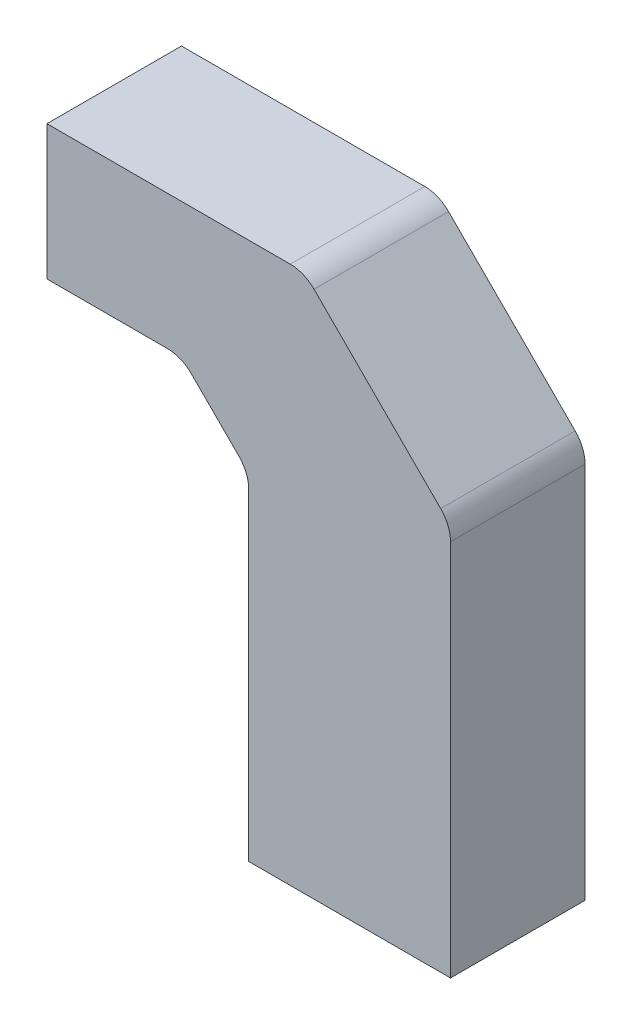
ISO-10303-21;
HEADER;
FILE_DESCRIPTION(('STEP AP214'),'2;1');
FILE_NAME('part.step','',(''),(''),'','','');
FILE_SCHEMA(('AUTOMOTIVE_DESIGN { 1 0 10303 214 1 1 1 1 }'));
ENDSEC;
DATA;
#1=APPLICATION_CONTEXT('core data for automotive mechanical design processes');
#2=APPLICATION_PROTOCOL_DEFINITION('international standard','automotive_design',2000,#1);
#3=PRODUCT_CONTEXT('',#1,'mechanical');
#4=PRODUCT('Part','Part','',(#3));
#5=PRODUCT_RELATED_PRODUCT_CATEGORY('part','',(#4));
#6=PRODUCT_DEFINITION_FORMATION('','',#4);
#7=PRODUCT_DEFINITION_CONTEXT('part definition',#1,'design');
#8=PRODUCT_DEFINITION('design','',#6,#7);
#9=PRODUCT_DEFINITION_SHAPE('','',#8);
#10=(LENGTH_UNIT() NAMED_UNIT(*) SI_UNIT(.MILLI.,.METRE.));
#11=(NAMED_UNIT(*) PLANE_ANGLE_UNIT() SI_UNIT($,.RADIAN.));
#12=(NAMED_UNIT(*) SI_UNIT($,.STERADIAN.) SOLID_ANGLE_UNIT());
#13=UNCERTAINTY_MEASURE_WITH_UNIT(LENGTH_MEASURE(1.E-05),#10,'distance_accuracy_value','');
#14=(GEOMETRIC_REPRESENTATION_CONTEXT(3) GLOBAL_UNCERTAINTY_ASSIGNED_CONTEXT((#13)) GLOBAL_UNIT_ASSIGNED_CONTEXT((#10,
#11,#12)) REPRESENTATION_CONTEXT('',''));
#15=CARTESIAN_POINT('',(0.,0.,0.));
#16=DIRECTION('',(0.,0.,1.));
#17=DIRECTION('',(1.,0.,0.));
#18=AXIS2_PLACEMENT_3D('',#15,#16,#17);
#19=CARTESIAN_POINT('',(8.2809794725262,57.5694456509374,25.4));
#20=DIRECTION('',(0.,-1.,0.));
#21=DIRECTION('',(1.,0.,0.));
#22=AXIS2_PLACEMENT_3D('',#19,#20,#21);
#23=PLANE('',#22);
#24=DIRECTION('',(-1.,0.,0.));
#25=VECTOR('',#24,1.);
#26=CARTESIAN_POINT('',(8.2809794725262,57.5694456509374,25.4));
#27=LINE('',#26,#25);
#28=CARTESIAN_POINT('',(5.65072335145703,57.5694456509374,25.4));
#29=VERTEX_POINT('',#28);
#30=CARTESIAN_POINT('',(-40.2884460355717,57.5694456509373,25.4));
#31=VERTEX_POINT('',#30);
#32=EDGE_CURVE('E231',#29,#31,#27,.T.);
#33=ORIENTED_EDGE('',*,*,#32,.F.);
#34=DIRECTION('',(0.,0.,-1.));
#35=VECTOR('',#34,1.);
#36=CARTESIAN_POINT('',(5.65072335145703,57.5694456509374,25.4));
#37=LINE('',#36,#35);
#38=CARTESIAN_POINT('',(5.65072335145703,57.5694456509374,0.));
#39=VERTEX_POINT('',#38);
#40=EDGE_CURVE('E127',#29,#39,#37,.T.);
#41=ORIENTED_EDGE('',*,*,#40,.T.);
#42=DIRECTION('',(-1.,0.,0.));
#43=VECTOR('',#42,1.);
#44=CARTESIAN_POINT('',(8.2809794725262,57.5694456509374,0.));
#45=LINE('',#44,#43);
#46=CARTESIAN_POINT('',(-40.2884460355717,57.5694456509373,0.));
#47=VERTEX_POINT('',#46);
#48=EDGE_CURVE('E121',#39,#47,#45,.T.);
#49=ORIENTED_EDGE('',*,*,#48,.T.);
#50=DIRECTION('',(0.,0.,-1.));
#51=VECTOR('',#50,1.);
#52=CARTESIAN_POINT('',(-40.2884460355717,57.5694456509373,25.4));
#53=LINE('',#52,#51);
#54=EDGE_CURVE('E125',#31,#47,#53,.T.);
#55=ORIENTED_EDGE('',*,*,#54,.F.);
#56=EDGE_LOOP('',(#33,#41,#49,#55));
#57=FACE_BOUND('',#56,.T.);
#58=ADVANCED_FACE('F31',(#57),#23,.F.);
#59=CARTESIAN_POINT('',(-40.2884460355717,57.5694456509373,25.4));
#60=DIRECTION('',(1.,0.,0.));
#61=DIRECTION('',(0.,1.,0.));
#62=AXIS2_PLACEMENT_3D('',#59,#60,#61);
#63=PLANE('',#62);
#64=CARTESIAN_POINT('',(-40.2884460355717,44.8694456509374,12.7));
#65=DIRECTION('',(-1.,0.,0.));
#66=DIRECTION('',(0.,-1.,0.));
#67=AXIS2_PLACEMENT_3D('',#64,#65,#66);
#68=CIRCLE('',#67,6.35);
#69=CARTESIAN_POINT('',(-40.2884460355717,38.5194456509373,12.7));
#70=VERTEX_POINT('',#69);
#71=EDGE_CURVE('E254',#70,#70,#68,.T.);
#72=ORIENTED_EDGE('',*,*,#71,.F.);
#73=EDGE_LOOP('',(#72));
#74=FACE_BOUND('',#73,.T.);
#75=DIRECTION('',(0.,-1.,0.));
#76=VECTOR('',#75,1.);
#77=CARTESIAN_POINT('',(-40.2884460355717,57.5694456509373,0.));
#78=LINE('',#77,#76);
#79=CARTESIAN_POINT('',(-40.2884460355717,32.1694456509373,0.));
#80=VERTEX_POINT('',#79);
#81=EDGE_CURVE('E129',#47,#80,#78,.T.);
#82=ORIENTED_EDGE('',*,*,#81,.T.);
#83=DIRECTION('',(0.,0.,-1.));
#84=VECTOR('',#83,1.);
#85=CARTESIAN_POINT('',(-40.2884460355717,32.1694456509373,25.4));
#86=LINE('',#85,#84);
#87=CARTESIAN_POINT('',(-40.2884460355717,32.1694456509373,25.4));
#88=VERTEX_POINT('',#87);
#89=EDGE_CURVE('E145',#88,#80,#86,.T.);
#90=ORIENTED_EDGE('',*,*,#89,.F.);
#91=DIRECTION('',(0.,-1.,0.));
#92=VECTOR('',#91,1.);
#93=CARTESIAN_POINT('',(-40.2884460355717,57.5694456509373,25.4));
#94=LINE('',#93,#92);
#95=EDGE_CURVE('E143',#31,#88,#94,.T.);
#96=ORIENTED_EDGE('',*,*,#95,.F.);
#97=ORIENTED_EDGE('',*,*,#54,.T.);
#98=EDGE_LOOP('',(#82,#90,#96,#97));
#99=FACE_BOUND('',#98,.T.);
#100=ADVANCED_FACE('F142',(#74,#99),#63,.F.);
#101=CARTESIAN_POINT('',(-40.2884460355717,32.1694456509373,25.4));
#102=DIRECTION('',(0.,1.,0.));
#103=DIRECTION('',(-1.,0.,0.));
#104=AXIS2_PLACEMENT_3D('',#101,#102,#103);
#105=PLANE('',#104);
#106=CARTESIAN_POINT('',(-27.5884460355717,32.1694456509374,12.7));
#107=DIRECTION('',(0.,-1.,0.));
#108=DIRECTION('',(1.,0.,0.));
#109=AXIS2_PLACEMENT_3D('',#106,#107,#108);
#110=CIRCLE('',#109,4.7625);
#111=CARTESIAN_POINT('',(-22.8259460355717,32.1694456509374,12.7));
#112=VERTEX_POINT('',#111);
#113=EDGE_CURVE('E260',#112,#112,#110,.T.);
#114=ORIENTED_EDGE('',*,*,#113,.F.);
#115=EDGE_LOOP('',(#114));
#116=FACE_BOUND('',#115,.T.);
#117=DIRECTION('',(1.,0.,0.));
#118=VECTOR('',#117,1.);
#119=CARTESIAN_POINT('',(-40.2884460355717,32.1694456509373,0.));
#120=LINE('',#119,#118);
#121=CARTESIAN_POINT('',(-17.5187021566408,32.1694456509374,0.));
#122=VERTEX_POINT('',#121);
#123=EDGE_CURVE('E136',#80,#122,#120,.T.);
#124=ORIENTED_EDGE('',*,*,#123,.T.);
#125=DIRECTION('',(0.,0.,-1.));
#126=VECTOR('',#125,1.);
#127=CARTESIAN_POINT('',(-17.5187021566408,32.1694456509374,25.4));
#128=LINE('',#127,#126);
#129=CARTESIAN_POINT('',(-17.5187021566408,32.1694456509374,25.4));
#130=VERTEX_POINT('',#129);
#131=EDGE_CURVE('E173',#122,#130,#128,.F.);
#132=ORIENTED_EDGE('',*,*,#131,.T.);
#133=DIRECTION('',(1.,0.,0.));
#134=VECTOR('',#133,1.);
#135=CARTESIAN_POINT('',(-40.2884460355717,32.1694456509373,25.4));
#136=LINE('',#135,#134);
#137=EDGE_CURVE('E192',#88,#130,#136,.T.);
#138=ORIENTED_EDGE('',*,*,#137,.F.);
#139=ORIENTED_EDGE('',*,*,#89,.T.);
#140=EDGE_LOOP('',(#124,#132,#138,#139));
#141=FACE_BOUND('',#140,.T.);
#142=ADVANCED_FACE('F183',(#116,#141),#105,.F.);
#143=CARTESIAN_POINT('',(-14.8884460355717,32.1694456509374,25.4));
#144=DIRECTION('',(0.707106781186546,0.707106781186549,0.));
#145=DIRECTION('',(-0.707106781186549,0.707106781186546,0.));
#146=AXIS2_PLACEMENT_3D('',#143,#144,#145);
#147=PLANE('',#146);
#148=DIRECTION('',(0.707106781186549,-0.707106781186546,0.));
#149=VECTOR('',#148,1.);
#150=CARTESIAN_POINT('',(-14.8884460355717,32.1694456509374,0.));
#151=LINE('',#150,#149);
#152=CARTESIAN_POINT('',(-13.0285740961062,30.3095737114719,0.));
#153=VERTEX_POINT('',#152);
#154=CARTESIAN_POINT('',(-4.04831797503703,21.3293175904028,0.));
#155=VERTEX_POINT('',#154);
#156=EDGE_CURVE('E178',#153,#155,#151,.T.);
#157=ORIENTED_EDGE('',*,*,#156,.T.);
#158=DIRECTION('',(0.,0.,-1.));
#159=VECTOR('',#158,1.);
#160=CARTESIAN_POINT('',(-4.04831797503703,21.3293175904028,25.4));
#161=LINE('',#160,#159);
#162=CARTESIAN_POINT('',(-4.04831797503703,21.3293175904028,25.4));
#163=VERTEX_POINT('',#162);
#164=EDGE_CURVE('E53',#155,#163,#161,.F.);
#165=ORIENTED_EDGE('',*,*,#164,.T.);
#166=DIRECTION('',(0.707106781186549,-0.707106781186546,0.));
#167=VECTOR('',#166,1.);
#168=CARTESIAN_POINT('',(-14.8884460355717,32.1694456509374,25.4));
#169=LINE('',#168,#167);
#170=CARTESIAN_POINT('',(-13.0285740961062,30.3095737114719,25.4));
#171=VERTEX_POINT('',#170);
#172=EDGE_CURVE('E191',#171,#163,#169,.T.);
#173=ORIENTED_EDGE('',*,*,#172,.F.);
#174=DIRECTION('',(0.,0.,-1.));
#175=VECTOR('',#174,1.);
#176=CARTESIAN_POINT('',(-13.0285740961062,30.3095737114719,0.));
#177=LINE('',#176,#175);
#178=EDGE_CURVE('E169',#171,#153,#177,.T.);
#179=ORIENTED_EDGE('',*,*,#178,.T.);
#180=EDGE_LOOP('',(#157,#165,#173,#179));
#181=FACE_BOUND('',#180,.T.);
#182=ADVANCED_FACE('F193',(#181),#147,.F.);
#183=CARTESIAN_POINT('',(-2.1884460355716,19.4694456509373,25.4));
#184=DIRECTION('',(1.,0.,0.));
#185=DIRECTION('',(0.,1.,0.));
#186=AXIS2_PLACEMENT_3D('',#183,#184,#185);
#187=PLANE('',#186);
#188=DIRECTION('',(0.,-1.,0.));
#189=VECTOR('',#188,1.);
#190=CARTESIAN_POINT('',(-2.1884460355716,19.4694456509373,25.4));
#191=LINE('',#190,#189);
#192=CARTESIAN_POINT('',(-2.1884460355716,16.8391895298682,25.4));
#193=VERTEX_POINT('',#192);
#194=CARTESIAN_POINT('',(-2.18844603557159,-44.0305543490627,25.4));
#195=VERTEX_POINT('',#194);
#196=EDGE_CURVE('E194',#193,#195,#191,.T.);
#197=ORIENTED_EDGE('',*,*,#196,.F.);
#198=DIRECTION('',(0.,0.,-1.));
#199=VECTOR('',#198,1.);
#200=CARTESIAN_POINT('',(-2.1884460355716,16.8391895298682,0.));
#201=LINE('',#200,#199);
#202=CARTESIAN_POINT('',(-2.1884460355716,16.8391895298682,0.));
#203=VERTEX_POINT('',#202);
#204=EDGE_CURVE('E166',#193,#203,#201,.T.);
#205=ORIENTED_EDGE('',*,*,#204,.T.);
#206=DIRECTION('',(0.,-1.,0.));
#207=VECTOR('',#206,1.);
#208=CARTESIAN_POINT('',(-2.1884460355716,19.4694456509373,0.));
#209=LINE('',#208,#207);
#210=CARTESIAN_POINT('',(-2.18844603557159,-44.0305543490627,0.));
#211=VERTEX_POINT('',#210);
#212=EDGE_CURVE('E220',#203,#211,#209,.T.);
#213=ORIENTED_EDGE('',*,*,#212,.T.);
#214=DIRECTION('',(0.,0.,-1.));
#215=VECTOR('',#214,1.);
#216=CARTESIAN_POINT('',(-2.18844603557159,-44.0305543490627,25.4));
#217=LINE('',#216,#215);
#218=EDGE_CURVE('E149',#195,#211,#217,.T.);
#219=ORIENTED_EDGE('',*,*,#218,.F.);
#220=EDGE_LOOP('',(#197,#205,#213,#219));
#221=FACE_BOUND('',#220,.T.);
#222=ADVANCED_FACE('F248',(#221),#187,.F.);
#223=CARTESIAN_POINT('',(-2.18844603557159,-44.0305543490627,25.4));
#224=DIRECTION('',(0.,1.,0.));
#225=DIRECTION('',(0.,0.,1.));
#226=AXIS2_PLACEMENT_3D('',#223,#224,#225);
#227=PLANE('',#226);
#228=DIRECTION('',(1.,0.,0.));
#229=VECTOR('',#228,1.);
#230=CARTESIAN_POINT('',(-2.18844603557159,-44.0305543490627,0.));
#231=LINE('',#230,#229);
#232=CARTESIAN_POINT('',(35.9115539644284,-44.0305543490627,0.));
#233=VERTEX_POINT('',#232);
#234=EDGE_CURVE('E216',#211,#233,#231,.T.);
#235=ORIENTED_EDGE('',*,*,#234,.T.);
#236=DIRECTION('',(0.,0.,-1.));
#237=VECTOR('',#236,1.);
#238=CARTESIAN_POINT('',(35.9115539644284,-44.0305543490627,25.4));
#239=LINE('',#238,#237);
#240=CARTESIAN_POINT('',(35.9115539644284,-44.0305543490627,25.4));
#241=VERTEX_POINT('',#240);
#242=EDGE_CURVE('E207',#241,#233,#239,.T.);
#243=ORIENTED_EDGE('',*,*,#242,.F.);
#244=DIRECTION('',(1.,0.,0.));
#245=VECTOR('',#244,1.);
#246=CARTESIAN_POINT('',(-2.18844603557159,-44.0305543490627,25.4));
#247=LINE('',#246,#245);
#248=EDGE_CURVE('E196',#195,#241,#247,.T.);
#249=ORIENTED_EDGE('',*,*,#248,.F.);
#250=ORIENTED_EDGE('',*,*,#218,.T.);
#251=EDGE_LOOP('',(#235,#243,#249,#250));
#252=FACE_BOUND('',#251,.T.);
#253=ADVANCED_FACE('F214',(#252),#227,.F.);
#254=CARTESIAN_POINT('',(35.9115539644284,-44.0305543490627,25.4));
#255=DIRECTION('',(-1.,0.,0.));
#256=DIRECTION('',(0.,0.,1.));
#257=AXIS2_PLACEMENT_3D('',#254,#255,#256);
#258=PLANE('',#257);
#259=DIRECTION('',(0.,1.,0.));
#260=VECTOR('',#259,1.);
#261=CARTESIAN_POINT('',(35.9115539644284,-44.0305543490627,0.));
#262=LINE('',#261,#260);
#263=CARTESIAN_POINT('',(35.9115539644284,27.3086150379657,0.));
#264=VERTEX_POINT('',#263);
#265=EDGE_CURVE('E222',#233,#264,#262,.T.);
#266=ORIENTED_EDGE('',*,*,#265,.T.);
#267=DIRECTION('',(0.,0.,-1.));
#268=VECTOR('',#267,1.);
#269=CARTESIAN_POINT('',(35.9115539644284,27.3086150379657,25.4));
#270=LINE('',#269,#268);
#271=CARTESIAN_POINT('',(35.9115539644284,27.3086150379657,25.4));
#272=VERTEX_POINT('',#271);
#273=EDGE_CURVE('E159',#264,#272,#270,.F.);
#274=ORIENTED_EDGE('',*,*,#273,.T.);
#275=DIRECTION('',(0.,1.,0.));
#276=VECTOR('',#275,1.);
#277=CARTESIAN_POINT('',(35.9115539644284,-44.0305543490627,25.4));
#278=LINE('',#277,#276);
#279=EDGE_CURVE('E202',#241,#272,#278,.T.);
#280=ORIENTED_EDGE('',*,*,#279,.F.);
#281=ORIENTED_EDGE('',*,*,#242,.T.);
#282=EDGE_LOOP('',(#266,#274,#280,#281));
#283=FACE_BOUND('',#282,.T.);
#284=ADVANCED_FACE('F245',(#283),#258,.F.);
#285=CARTESIAN_POINT('',(8.2809794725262,57.5694456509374,25.4));
#286=DIRECTION('',(-0.707106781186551,-0.707106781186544,0.));
#287=DIRECTION('',(0.707106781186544,-0.707106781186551,0.));
#288=AXIS2_PLACEMENT_3D('',#285,#286,#287);
#289=PLANE('',#288);
#290=DIRECTION('',(-0.707106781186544,0.707106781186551,0.));
#291=VECTOR('',#290,1.);
#292=CARTESIAN_POINT('',(8.2809794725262,57.5694456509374,25.4));
#293=LINE('',#292,#291);
#294=CARTESIAN_POINT('',(34.051682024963,31.7987430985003,25.4));
#295=VERTEX_POINT('',#294);
#296=CARTESIAN_POINT('',(10.1408514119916,55.7095737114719,25.4));
#297=VERTEX_POINT('',#296);
#298=EDGE_CURVE('E204',#295,#297,#293,.T.);
#299=ORIENTED_EDGE('',*,*,#298,.F.);
#300=DIRECTION('',(0.,0.,-1.));
#301=VECTOR('',#300,1.);
#302=CARTESIAN_POINT('',(34.051682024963,31.7987430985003,25.4));
#303=LINE('',#302,#301);
#304=CARTESIAN_POINT('',(34.051682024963,31.7987430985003,0.));
#305=VERTEX_POINT('',#304);
#306=EDGE_CURVE('E147',#295,#305,#303,.T.);
#307=ORIENTED_EDGE('',*,*,#306,.T.);
#308=DIRECTION('',(-0.707106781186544,0.707106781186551,0.));
#309=VECTOR('',#308,1.);
#310=CARTESIAN_POINT('',(8.2809794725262,57.5694456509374,0.));
#311=LINE('',#310,#309);
#312=CARTESIAN_POINT('',(10.1408514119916,55.7095737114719,0.));
#313=VERTEX_POINT('',#312);
#314=EDGE_CURVE('E224',#305,#313,#311,.T.);
#315=ORIENTED_EDGE('',*,*,#314,.T.);
#316=DIRECTION('',(0.,0.,-1.));
#317=VECTOR('',#316,1.);
#318=CARTESIAN_POINT('',(10.1408514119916,55.7095737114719,25.4));
#319=LINE('',#318,#317);
#320=EDGE_CURVE('E144',#313,#297,#319,.F.);
#321=ORIENTED_EDGE('',*,*,#320,.T.);
#322=EDGE_LOOP('',(#299,#307,#315,#321));
#323=FACE_BOUND('',#322,.T.);
#324=ADVANCED_FACE('F238',(#323),#289,.F.);
#325=CARTESIAN_POINT('',(-2.1884460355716,57.5694456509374,25.4));
#326=DIRECTION('',(0.,0.,1.));
#327=DIRECTION('',(1.,0.,0.));
#328=AXIS2_PLACEMENT_3D('',#325,#326,#327);
#329=PLANE('',#328);
#330=ORIENTED_EDGE('',*,*,#279,.T.);
#331=CARTESIAN_POINT('',(29.5615539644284,27.3086150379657,25.4));
#332=DIRECTION('',(0.,0.,1.));
#333=DIRECTION('',(1.,0.,0.));
#334=AXIS2_PLACEMENT_3D('',#331,#332,#333);
#335=CIRCLE('',#334,6.35);
#336=EDGE_CURVE('E163',#272,#295,#335,.T.);
#337=ORIENTED_EDGE('',*,*,#336,.T.);
#338=ORIENTED_EDGE('',*,*,#298,.T.);
#339=CARTESIAN_POINT('',(5.65072335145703,51.2194456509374,25.4));
#340=DIRECTION('',(0.,0.,1.));
#341=DIRECTION('',(1.,0.,0.));
#342=AXIS2_PLACEMENT_3D('',#339,#340,#341);
#343=CIRCLE('',#342,6.35);
#344=EDGE_CURVE('E161',#297,#29,#343,.T.);
#345=ORIENTED_EDGE('',*,*,#344,.T.);
#346=ORIENTED_EDGE('',*,*,#32,.T.);
#347=ORIENTED_EDGE('',*,*,#95,.T.);
#348=ORIENTED_EDGE('',*,*,#137,.T.);
#349=CARTESIAN_POINT('',(-17.5187021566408,25.8194456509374,25.4));
#350=DIRECTION('',(0.,0.,1.));
#351=DIRECTION('',(1.,0.,0.));
#352=AXIS2_PLACEMENT_3D('',#349,#350,#351);
#353=CIRCLE('',#352,6.35);
#354=EDGE_CURVE('E11',#130,#171,#353,.F.);
#355=ORIENTED_EDGE('',*,*,#354,.T.);
#356=ORIENTED_EDGE('',*,*,#172,.T.);
#357=CARTESIAN_POINT('',(-8.5384460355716,16.8391895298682,25.4));
#358=DIRECTION('',(0.,0.,1.));
#359=DIRECTION('',(1.,0.,0.));
#360=AXIS2_PLACEMENT_3D('',#357,#358,#359);
#361=CIRCLE('',#360,6.35);
#362=EDGE_CURVE('E45',#163,#193,#361,.F.);
#363=ORIENTED_EDGE('',*,*,#362,.T.);
#364=ORIENTED_EDGE('',*,*,#196,.T.);
#365=ORIENTED_EDGE('',*,*,#248,.T.);
#366=EDGE_LOOP('',(#330,#337,#338,#345,#346,#347,#348,#355,#356,#363,#364,#365));
#367=FACE_BOUND('',#366,.T.);
#368=ADVANCED_FACE('F190',(#367),#329,.T.);
#369=CARTESIAN_POINT('',(-2.1884460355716,57.5694456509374,0.));
#370=DIRECTION('',(0.,0.,1.));
#371=DIRECTION('',(1.,0.,0.));
#372=AXIS2_PLACEMENT_3D('',#369,#370,#371);
#373=PLANE('',#372);
#374=ORIENTED_EDGE('',*,*,#314,.F.);
#375=CARTESIAN_POINT('',(29.5615539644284,27.3086150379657,0.));
#376=DIRECTION('',(0.,0.,1.));
#377=DIRECTION('',(1.,0.,0.));
#378=AXIS2_PLACEMENT_3D('',#375,#376,#377);
#379=CIRCLE('',#378,6.35);
#380=EDGE_CURVE('E157',#305,#264,#379,.F.);
#381=ORIENTED_EDGE('',*,*,#380,.T.);
#382=ORIENTED_EDGE('',*,*,#265,.F.);
#383=ORIENTED_EDGE('',*,*,#234,.F.);
#384=ORIENTED_EDGE('',*,*,#212,.F.);
#385=CARTESIAN_POINT('',(-8.5384460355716,16.8391895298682,0.));
#386=DIRECTION('',(0.,0.,1.));
#387=DIRECTION('',(1.,0.,0.));
#388=AXIS2_PLACEMENT_3D('',#385,#386,#387);
#389=CIRCLE('',#388,6.35);
#390=EDGE_CURVE('E175',#203,#155,#389,.T.);
#391=ORIENTED_EDGE('',*,*,#390,.T.);
#392=ORIENTED_EDGE('',*,*,#156,.F.);
#393=CARTESIAN_POINT('',(-17.5187021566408,25.8194456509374,0.));
#394=DIRECTION('',(0.,0.,1.));
#395=DIRECTION('',(1.,0.,0.));
#396=AXIS2_PLACEMENT_3D('',#393,#394,#395);
#397=CIRCLE('',#396,6.35);
#398=EDGE_CURVE('E38',#153,#122,#397,.T.);
#399=ORIENTED_EDGE('',*,*,#398,.T.);
#400=ORIENTED_EDGE('',*,*,#123,.F.);
#401=ORIENTED_EDGE('',*,*,#81,.F.);
#402=ORIENTED_EDGE('',*,*,#48,.F.);
#403=CARTESIAN_POINT('',(5.65072335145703,51.2194456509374,0.));
#404=DIRECTION('',(0.,0.,1.));
#405=DIRECTION('',(1.,0.,0.));
#406=AXIS2_PLACEMENT_3D('',#403,#404,#405);
#407=CIRCLE('',#406,6.35);
#408=EDGE_CURVE('E155',#39,#313,#407,.F.);
#409=ORIENTED_EDGE('',*,*,#408,.T.);
#410=EDGE_LOOP('',(#374,#381,#382,#383,#384,#391,#392,#399,#400,#401,#402,#409));
#411=FACE_BOUND('',#410,.T.);
#412=ADVANCED_FACE('F134',(#411),#373,.F.);
#413=CARTESIAN_POINT('',(29.5615539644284,27.3086150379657,25.4));
#414=DIRECTION('',(0.,0.,-1.));
#415=DIRECTION('',(-1.,0.,0.));
#416=AXIS2_PLACEMENT_3D('',#413,#414,#415);
#417=CYLINDRICAL_SURFACE('',#416,6.35);
#418=ORIENTED_EDGE('',*,*,#336,.F.);
#419=ORIENTED_EDGE('',*,*,#273,.F.);
#420=ORIENTED_EDGE('',*,*,#380,.F.);
#421=ORIENTED_EDGE('',*,*,#306,.F.);
#422=EDGE_LOOP('',(#418,#419,#420,#421));
#423=FACE_BOUND('',#422,.T.);
#424=ADVANCED_FACE('F242',(#423),#417,.T.);
#425=CARTESIAN_POINT('',(5.65072335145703,51.2194456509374,25.4));
#426=DIRECTION('',(0.,0.,-1.));
#427=DIRECTION('',(-1.,0.,0.));
#428=AXIS2_PLACEMENT_3D('',#425,#426,#427);
#429=CYLINDRICAL_SURFACE('',#428,6.35);
#430=ORIENTED_EDGE('',*,*,#344,.F.);
#431=ORIENTED_EDGE('',*,*,#320,.F.);
#432=ORIENTED_EDGE('',*,*,#408,.F.);
#433=ORIENTED_EDGE('',*,*,#40,.F.);
#434=EDGE_LOOP('',(#430,#431,#432,#433));
#435=FACE_BOUND('',#434,.T.);
#436=ADVANCED_FACE('F234',(#435),#429,.T.);
#437=CARTESIAN_POINT('',(-8.5384460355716,16.8391895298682,25.4));
#438=DIRECTION('',(0.,0.,1.));
#439=DIRECTION('',(1.,0.,0.));
#440=AXIS2_PLACEMENT_3D('',#437,#438,#439);
#441=CYLINDRICAL_SURFACE('',#440,6.35);
#442=ORIENTED_EDGE('',*,*,#362,.F.);
#443=ORIENTED_EDGE('',*,*,#164,.F.);
#444=ORIENTED_EDGE('',*,*,#390,.F.);
#445=ORIENTED_EDGE('',*,*,#204,.F.);
#446=EDGE_LOOP('',(#442,#443,#444,#445));
#447=FACE_BOUND('',#446,.T.);
#448=ADVANCED_FACE('F250',(#447),#441,.F.);
#449=CARTESIAN_POINT('',(-17.5187021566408,25.8194456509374,25.4));
#450=DIRECTION('',(0.,0.,1.));
#451=DIRECTION('',(1.,0.,0.));
#452=AXIS2_PLACEMENT_3D('',#449,#450,#451);
#453=CYLINDRICAL_SURFACE('',#452,6.35);
#454=ORIENTED_EDGE('',*,*,#354,.F.);
#455=ORIENTED_EDGE('',*,*,#131,.F.);
#456=ORIENTED_EDGE('',*,*,#398,.F.);
#457=ORIENTED_EDGE('',*,*,#178,.F.);
#458=EDGE_LOOP('',(#454,#455,#456,#457));
#459=FACE_BOUND('',#458,.T.);
#460=ADVANCED_FACE('F188',(#459),#453,.F.);
#461=CARTESIAN_POINT('',(-14.8884460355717,44.8694456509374,12.7));
#462=DIRECTION('',(-1.,0.,0.));
#463=DIRECTION('',(0.,-1.,0.));
#464=AXIS2_PLACEMENT_3D('',#461,#462,#463);
#465=CYLINDRICAL_SURFACE('',#464,6.35);
#466=CARTESIAN_POINT('',(-14.8884460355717,44.8694456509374,12.7));
#467=DIRECTION('',(-1.,0.,0.));
#468=DIRECTION('',(0.,-1.,0.));
#469=AXIS2_PLACEMENT_3D('',#466,#467,#468);
#470=CIRCLE('',#469,6.35);
#471=CARTESIAN_POINT('',(-14.8884460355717,38.5194456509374,12.7));
#472=VERTEX_POINT('',#471);
#473=EDGE_CURVE('E130',#472,#472,#470,.T.);
#474=ORIENTED_EDGE('',*,*,#473,.F.);
#475=EDGE_LOOP('',(#474));
#476=FACE_BOUND('',#475,.T.);
#477=ORIENTED_EDGE('',*,*,#71,.T.);
#478=EDGE_LOOP('',(#477));
#479=FACE_BOUND('',#478,.T.);
#480=ADVANCED_FACE('F294',(#476,#479),#465,.F.);
#481=CARTESIAN_POINT('',(-14.8884460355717,44.8694456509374,12.7));
#482=DIRECTION('',(-1.,0.,0.));
#483=DIRECTION('',(0.,-1.,0.));
#484=AXIS2_PLACEMENT_3D('',#481,#482,#483);
#485=PLANE('',#484);
#486=ORIENTED_EDGE('',*,*,#473,.T.);
#487=EDGE_LOOP('',(#486));
#488=FACE_BOUND('',#487,.T.);
#489=ADVANCED_FACE('F299',(#488),#485,.T.);
#490=CARTESIAN_POINT('',(-27.5884460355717,37.2494456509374,12.7));
#491=DIRECTION('',(0.,-1.,0.));
#492=DIRECTION('',(1.,0.,0.));
#493=AXIS2_PLACEMENT_3D('',#490,#491,#492);
#494=CYLINDRICAL_SURFACE('',#493,4.7625);
#495=CARTESIAN_POINT('',(-27.5884460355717,37.2494456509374,12.7));
#496=DIRECTION('',(0.,-1.,0.));
#497=DIRECTION('',(1.,0.,0.));
#498=AXIS2_PLACEMENT_3D('',#495,#496,#497);
#499=CIRCLE('',#498,4.7625);
#500=CARTESIAN_POINT('',(-22.8259460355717,37.2494456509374,12.7));
#501=VERTEX_POINT('',#500);
#502=EDGE_CURVE('E257',#501,#501,#499,.T.);
#503=ORIENTED_EDGE('',*,*,#502,.F.);
#504=EDGE_LOOP('',(#503));
#505=FACE_BOUND('',#504,.T.);
#506=ORIENTED_EDGE('',*,*,#113,.T.);
#507=EDGE_LOOP('',(#506));
#508=FACE_BOUND('',#507,.T.);
#509=ADVANCED_FACE('F264',(#505,#508),#494,.F.);
#510=CARTESIAN_POINT('',(-27.5884460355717,37.2494456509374,12.7));
#511=DIRECTION('',(0.,-1.,0.));
#512=DIRECTION('',(1.,0.,0.));
#513=AXIS2_PLACEMENT_3D('',#510,#511,#512);
#514=PLANE('',#513);
#515=ORIENTED_EDGE('',*,*,#502,.T.);
#516=EDGE_LOOP('',(#515));
#517=FACE_BOUND('',#516,.T.);
#518=ADVANCED_FACE('F322',(#517),#514,.T.);
#519=CLOSED_SHELL('',(#58,#100,#142,#182,#222,#253,#284,#324,#368,#412,#424,#436,#448,#460,#480,
#489,#509,#518));
#520=MANIFOLD_SOLID_BREP('B2',#519);
#521=ADVANCED_BREP_SHAPE_REPRESENTATION('',(#18,#520),#14);
#522=SHAPE_DEFINITION_REPRESENTATION(#9,#521);
ENDSEC;
END-ISO-10303-21;
